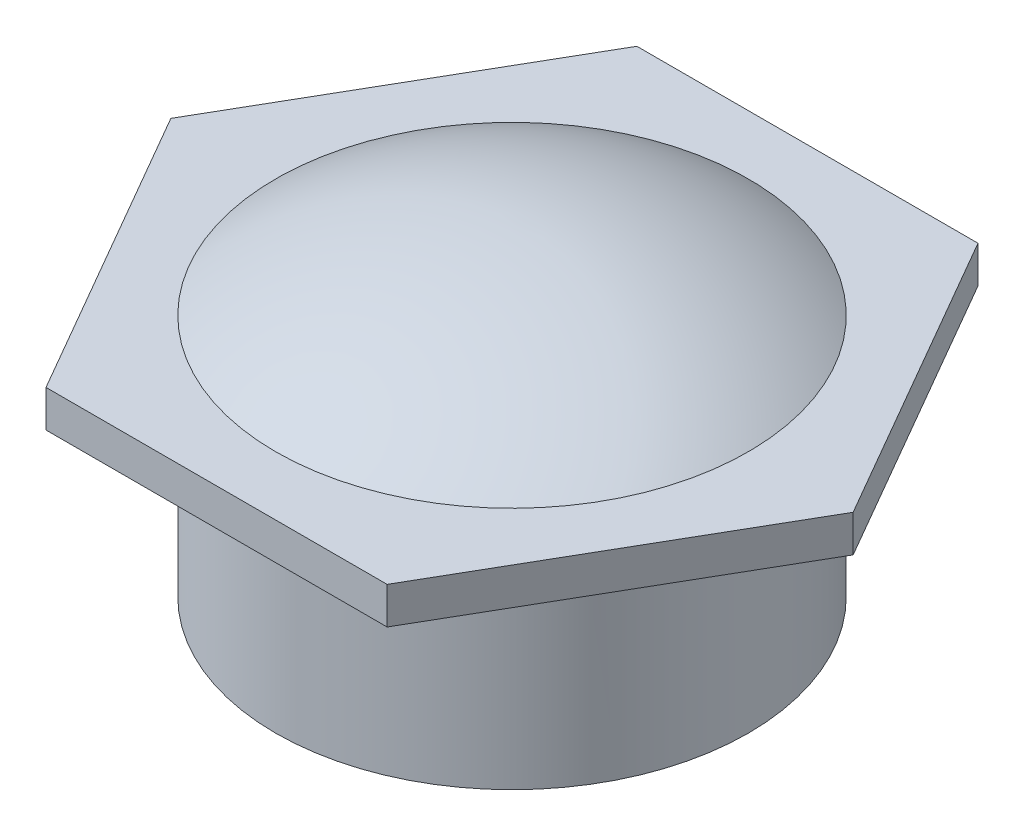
ISO-10303-21;
HEADER;
FILE_DESCRIPTION(('STEP AP214'),'2;1');
FILE_NAME('part.step','',(''),(''),'','','');
FILE_SCHEMA(('AUTOMOTIVE_DESIGN { 1 0 10303 214 1 1 1 1 }'));
ENDSEC;
DATA;
#1=APPLICATION_CONTEXT('core data for automotive mechanical design processes');
#2=APPLICATION_PROTOCOL_DEFINITION('international standard','automotive_design',2000,#1);
#3=PRODUCT_CONTEXT('',#1,'mechanical');
#4=PRODUCT('Part','Part','',(#3));
#5=PRODUCT_RELATED_PRODUCT_CATEGORY('part','',(#4));
#6=PRODUCT_DEFINITION_FORMATION('','',#4);
#7=PRODUCT_DEFINITION_CONTEXT('part definition',#1,'design');
#8=PRODUCT_DEFINITION('design','',#6,#7);
#9=PRODUCT_DEFINITION_SHAPE('','',#8);
#10=(LENGTH_UNIT() NAMED_UNIT(*) SI_UNIT(.MILLI.,.METRE.));
#11=(NAMED_UNIT(*) PLANE_ANGLE_UNIT() SI_UNIT($,.RADIAN.));
#12=(NAMED_UNIT(*) SI_UNIT($,.STERADIAN.) SOLID_ANGLE_UNIT());
#13=UNCERTAINTY_MEASURE_WITH_UNIT(LENGTH_MEASURE(1.E-05),#10,'distance_accuracy_value','');
#14=(GEOMETRIC_REPRESENTATION_CONTEXT(3) GLOBAL_UNCERTAINTY_ASSIGNED_CONTEXT((#13)) GLOBAL_UNIT_ASSIGNED_CONTEXT((#10,
#11,#12)) REPRESENTATION_CONTEXT('',''));
#15=CARTESIAN_POINT('',(0.,0.,0.));
#16=DIRECTION('',(0.,0.,1.));
#17=DIRECTION('',(1.,0.,0.));
#18=AXIS2_PLACEMENT_3D('',#15,#16,#17);
#19=CARTESIAN_POINT('',(0.,2.5,0.));
#20=DIRECTION('',(0.,1.,0.));
#21=DIRECTION('',(0.,0.,1.));
#22=AXIS2_PLACEMENT_3D('',#19,#20,#21);
#23=PLANE('',#22);
#24=DIRECTION('',(1.,0.,0.));
#25=VECTOR('',#24,1.);
#26=CARTESIAN_POINT('',(-11.5470053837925,2.5,20.));
#27=LINE('',#26,#25);
#28=CARTESIAN_POINT('',(-11.5470053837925,2.5,20.));
#29=VERTEX_POINT('',#28);
#30=CARTESIAN_POINT('',(11.5470053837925,2.5,20.));
#31=VERTEX_POINT('',#30);
#32=EDGE_CURVE('E142',#29,#31,#27,.T.);
#33=ORIENTED_EDGE('',*,*,#32,.T.);
#34=DIRECTION('',(0.5,0.,-0.866025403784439));
#35=VECTOR('',#34,1.);
#36=CARTESIAN_POINT('',(11.5470053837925,2.5,20.));
#37=LINE('',#36,#35);
#38=CARTESIAN_POINT('',(23.094010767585,2.5,0.));
#39=VERTEX_POINT('',#38);
#40=EDGE_CURVE('E100',#31,#39,#37,.T.);
#41=ORIENTED_EDGE('',*,*,#40,.T.);
#42=DIRECTION('',(-0.5,0.,-0.866025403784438));
#43=VECTOR('',#42,1.);
#44=CARTESIAN_POINT('',(23.094010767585,2.5,0.));
#45=LINE('',#44,#43);
#46=CARTESIAN_POINT('',(11.5470053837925,2.5,-20.));
#47=VERTEX_POINT('',#46);
#48=EDGE_CURVE('E113',#39,#47,#45,.T.);
#49=ORIENTED_EDGE('',*,*,#48,.T.);
#50=DIRECTION('',(-1.,0.,0.));
#51=VECTOR('',#50,1.);
#52=CARTESIAN_POINT('',(11.5470053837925,2.5,-20.));
#53=LINE('',#52,#51);
#54=CARTESIAN_POINT('',(-11.5470053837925,2.5,-20.));
#55=VERTEX_POINT('',#54);
#56=EDGE_CURVE('E107',#47,#55,#53,.T.);
#57=ORIENTED_EDGE('',*,*,#56,.T.);
#58=DIRECTION('',(-0.5,0.,0.866025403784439));
#59=VECTOR('',#58,1.);
#60=CARTESIAN_POINT('',(-11.5470053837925,2.5,-20.));
#61=LINE('',#60,#59);
#62=CARTESIAN_POINT('',(-23.094010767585,2.5,0.));
#63=VERTEX_POINT('',#62);
#64=EDGE_CURVE('E111',#55,#63,#61,.T.);
#65=ORIENTED_EDGE('',*,*,#64,.T.);
#66=DIRECTION('',(0.5,0.,0.866025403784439));
#67=VECTOR('',#66,1.);
#68=CARTESIAN_POINT('',(-23.094010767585,2.5,0.));
#69=LINE('',#68,#67);
#70=EDGE_CURVE('E62',#63,#29,#69,.T.);
#71=ORIENTED_EDGE('',*,*,#70,.T.);
#72=EDGE_LOOP('',(#33,#41,#49,#57,#65,#71));
#73=FACE_BOUND('',#72,.T.);
#74=CARTESIAN_POINT('',(0.,2.5,0.));
#75=DIRECTION('',(0.,1.,0.));
#76=DIRECTION('',(0.,0.,1.));
#77=AXIS2_PLACEMENT_3D('',#74,#75,#76);
#78=CIRCLE('',#77,16.);
#79=CARTESIAN_POINT('',(0.,2.5,16.));
#80=VERTEX_POINT('',#79);
#81=EDGE_CURVE('E11',#80,#80,#78,.F.);
#82=ORIENTED_EDGE('',*,*,#81,.T.);
#83=EDGE_LOOP('',(#82));
#84=FACE_BOUND('',#83,.T.);
#85=ADVANCED_FACE('F44',(#73,#84),#23,.T.);
#86=CARTESIAN_POINT('',(-11.5470053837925,2.5,20.));
#87=DIRECTION('',(0.,0.,-1.));
#88=DIRECTION('',(-1.,0.,0.));
#89=AXIS2_PLACEMENT_3D('',#86,#87,#88);
#90=PLANE('',#89);
#91=DIRECTION('',(1.,0.,0.));
#92=VECTOR('',#91,1.);
#93=CARTESIAN_POINT('',(-11.5470053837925,0.,20.));
#94=LINE('',#93,#92);
#95=CARTESIAN_POINT('',(-11.5470053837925,0.,20.));
#96=VERTEX_POINT('',#95);
#97=CARTESIAN_POINT('',(11.5470053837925,0.,20.));
#98=VERTEX_POINT('',#97);
#99=EDGE_CURVE('E131',#96,#98,#94,.T.);
#100=ORIENTED_EDGE('',*,*,#99,.T.);
#101=DIRECTION('',(0.,-1.,0.));
#102=VECTOR('',#101,1.);
#103=CARTESIAN_POINT('',(11.5470053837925,2.5,20.));
#104=LINE('',#103,#102);
#105=EDGE_CURVE('E149',#31,#98,#104,.T.);
#106=ORIENTED_EDGE('',*,*,#105,.F.);
#107=ORIENTED_EDGE('',*,*,#32,.F.);
#108=DIRECTION('',(0.,-1.,0.));
#109=VECTOR('',#108,1.);
#110=CARTESIAN_POINT('',(-11.5470053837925,2.5,20.));
#111=LINE('',#110,#109);
#112=EDGE_CURVE('E127',#29,#96,#111,.T.);
#113=ORIENTED_EDGE('',*,*,#112,.T.);
#114=EDGE_LOOP('',(#100,#106,#107,#113));
#115=FACE_BOUND('',#114,.T.);
#116=ADVANCED_FACE('F165',(#115),#90,.F.);
#117=CARTESIAN_POINT('',(11.5470053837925,2.5,20.));
#118=DIRECTION('',(-0.866025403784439,0.,-0.5));
#119=DIRECTION('',(-0.5,0.,0.866025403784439));
#120=AXIS2_PLACEMENT_3D('',#117,#118,#119);
#121=PLANE('',#120);
#122=DIRECTION('',(0.5,0.,-0.866025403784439));
#123=VECTOR('',#122,1.);
#124=CARTESIAN_POINT('',(11.5470053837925,0.,20.));
#125=LINE('',#124,#123);
#126=CARTESIAN_POINT('',(23.094010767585,0.,0.));
#127=VERTEX_POINT('',#126);
#128=EDGE_CURVE('E134',#98,#127,#125,.T.);
#129=ORIENTED_EDGE('',*,*,#128,.T.);
#130=DIRECTION('',(0.,-1.,0.));
#131=VECTOR('',#130,1.);
#132=CARTESIAN_POINT('',(23.094010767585,2.5,0.));
#133=LINE('',#132,#131);
#134=EDGE_CURVE('E146',#39,#127,#133,.T.);
#135=ORIENTED_EDGE('',*,*,#134,.F.);
#136=ORIENTED_EDGE('',*,*,#40,.F.);
#137=ORIENTED_EDGE('',*,*,#105,.T.);
#138=EDGE_LOOP('',(#129,#135,#136,#137));
#139=FACE_BOUND('',#138,.T.);
#140=ADVANCED_FACE('F181',(#139),#121,.F.);
#141=CARTESIAN_POINT('',(23.094010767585,2.5,0.));
#142=DIRECTION('',(-0.866025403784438,0.,0.5));
#143=DIRECTION('',(0.5,0.,0.866025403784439));
#144=AXIS2_PLACEMENT_3D('',#141,#142,#143);
#145=PLANE('',#144);
#146=DIRECTION('',(-0.5,0.,-0.866025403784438));
#147=VECTOR('',#146,1.);
#148=CARTESIAN_POINT('',(23.094010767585,0.,0.));
#149=LINE('',#148,#147);
#150=CARTESIAN_POINT('',(11.5470053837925,0.,-20.));
#151=VERTEX_POINT('',#150);
#152=EDGE_CURVE('E137',#127,#151,#149,.T.);
#153=ORIENTED_EDGE('',*,*,#152,.T.);
#154=DIRECTION('',(0.,-1.,0.));
#155=VECTOR('',#154,1.);
#156=CARTESIAN_POINT('',(11.5470053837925,2.5,-20.));
#157=LINE('',#156,#155);
#158=EDGE_CURVE('E122',#47,#151,#157,.T.);
#159=ORIENTED_EDGE('',*,*,#158,.F.);
#160=ORIENTED_EDGE('',*,*,#48,.F.);
#161=ORIENTED_EDGE('',*,*,#134,.T.);
#162=EDGE_LOOP('',(#153,#159,#160,#161));
#163=FACE_BOUND('',#162,.T.);
#164=ADVANCED_FACE('F210',(#163),#145,.F.);
#165=CARTESIAN_POINT('',(11.5470053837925,2.5,-20.));
#166=DIRECTION('',(0.,0.,1.));
#167=DIRECTION('',(1.,0.,0.));
#168=AXIS2_PLACEMENT_3D('',#165,#166,#167);
#169=PLANE('',#168);
#170=DIRECTION('',(-1.,0.,0.));
#171=VECTOR('',#170,1.);
#172=CARTESIAN_POINT('',(11.5470053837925,0.,-20.));
#173=LINE('',#172,#171);
#174=CARTESIAN_POINT('',(-11.5470053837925,0.,-20.));
#175=VERTEX_POINT('',#174);
#176=EDGE_CURVE('E121',#151,#175,#173,.T.);
#177=ORIENTED_EDGE('',*,*,#176,.T.);
#178=DIRECTION('',(0.,-1.,0.));
#179=VECTOR('',#178,1.);
#180=CARTESIAN_POINT('',(-11.5470053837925,2.5,-20.));
#181=LINE('',#180,#179);
#182=EDGE_CURVE('E118',#55,#175,#181,.T.);
#183=ORIENTED_EDGE('',*,*,#182,.F.);
#184=ORIENTED_EDGE('',*,*,#56,.F.);
#185=ORIENTED_EDGE('',*,*,#158,.T.);
#186=EDGE_LOOP('',(#177,#183,#184,#185));
#187=FACE_BOUND('',#186,.T.);
#188=ADVANCED_FACE('F119',(#187),#169,.F.);
#189=CARTESIAN_POINT('',(-11.5470053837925,2.5,-20.));
#190=DIRECTION('',(0.866025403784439,0.,0.5));
#191=DIRECTION('',(0.5,0.,-0.866025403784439));
#192=AXIS2_PLACEMENT_3D('',#189,#190,#191);
#193=PLANE('',#192);
#194=DIRECTION('',(-0.5,0.,0.866025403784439));
#195=VECTOR('',#194,1.);
#196=CARTESIAN_POINT('',(-11.5470053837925,0.,-20.));
#197=LINE('',#196,#195);
#198=CARTESIAN_POINT('',(-23.094010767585,0.,0.));
#199=VERTEX_POINT('',#198);
#200=EDGE_CURVE('E85',#175,#199,#197,.T.);
#201=ORIENTED_EDGE('',*,*,#200,.T.);
#202=DIRECTION('',(0.,-1.,0.));
#203=VECTOR('',#202,1.);
#204=CARTESIAN_POINT('',(-23.094010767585,2.5,0.));
#205=LINE('',#204,#203);
#206=EDGE_CURVE('E123',#63,#199,#205,.T.);
#207=ORIENTED_EDGE('',*,*,#206,.F.);
#208=ORIENTED_EDGE('',*,*,#64,.F.);
#209=ORIENTED_EDGE('',*,*,#182,.T.);
#210=EDGE_LOOP('',(#201,#207,#208,#209));
#211=FACE_BOUND('',#210,.T.);
#212=ADVANCED_FACE('F125',(#211),#193,.F.);
#213=CARTESIAN_POINT('',(-23.094010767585,2.5,0.));
#214=DIRECTION('',(0.866025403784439,0.,-0.5));
#215=DIRECTION('',(-0.5,0.,-0.866025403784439));
#216=AXIS2_PLACEMENT_3D('',#213,#214,#215);
#217=PLANE('',#216);
#218=DIRECTION('',(0.5,0.,0.866025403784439));
#219=VECTOR('',#218,1.);
#220=CARTESIAN_POINT('',(-23.094010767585,0.,0.));
#221=LINE('',#220,#219);
#222=EDGE_CURVE('E91',#199,#96,#221,.T.);
#223=ORIENTED_EDGE('',*,*,#222,.T.);
#224=ORIENTED_EDGE('',*,*,#112,.F.);
#225=ORIENTED_EDGE('',*,*,#70,.F.);
#226=ORIENTED_EDGE('',*,*,#206,.T.);
#227=EDGE_LOOP('',(#223,#224,#225,#226));
#228=FACE_BOUND('',#227,.T.);
#229=ADVANCED_FACE('F167',(#228),#217,.F.);
#230=CARTESIAN_POINT('',(0.,-20.6,0.));
#231=DIRECTION('',(0.,0.,1.));
#232=DIRECTION('',(1.,0.,0.));
#233=AXIS2_PLACEMENT_3D('',#230,#231,#232);
#234=SPHERICAL_SURFACE('',#233,28.1);
#235=CARTESIAN_POINT('',(0.,-20.6,0.));
#236=DIRECTION('',(0.,1.,0.));
#237=DIRECTION('',(0.,0.,1.));
#238=AXIS2_PLACEMENT_3D('',#235,#236,#237);
#239=SPHERICAL_SURFACE('',#238,28.1);
#240=ORIENTED_EDGE('',*,*,#81,.F.);
#241=EDGE_LOOP('',(#240));
#242=FACE_BOUND('',#241,.T.);
#243=ADVANCED_FACE('F46',(#242),#239,.T.);
#244=CARTESIAN_POINT('',(0.,0.,0.));
#245=DIRECTION('',(0.,1.,0.));
#246=DIRECTION('',(0.,0.,1.));
#247=AXIS2_PLACEMENT_3D('',#244,#245,#246);
#248=PLANE('',#247);
#249=CARTESIAN_POINT('',(0.,0.,0.));
#250=DIRECTION('',(0.,1.,0.));
#251=DIRECTION('',(0.,0.,1.));
#252=AXIS2_PLACEMENT_3D('',#249,#250,#251);
#253=CIRCLE('',#252,16.);
#254=CARTESIAN_POINT('',(0.,0.,16.));
#255=VERTEX_POINT('',#254);
#256=EDGE_CURVE('E54',#255,#255,#253,.F.);
#257=ORIENTED_EDGE('',*,*,#256,.F.);
#258=EDGE_LOOP('',(#257));
#259=FACE_BOUND('',#258,.T.);
#260=ORIENTED_EDGE('',*,*,#99,.F.);
#261=ORIENTED_EDGE('',*,*,#222,.F.);
#262=ORIENTED_EDGE('',*,*,#200,.F.);
#263=ORIENTED_EDGE('',*,*,#176,.F.);
#264=ORIENTED_EDGE('',*,*,#152,.F.);
#265=ORIENTED_EDGE('',*,*,#128,.F.);
#266=EDGE_LOOP('',(#260,#261,#262,#263,#264,#265));
#267=FACE_BOUND('',#266,.T.);
#268=ADVANCED_FACE('F155',(#259,#267),#248,.F.);
#269=CARTESIAN_POINT('',(0.,-14.,0.));
#270=DIRECTION('',(0.,-1.,0.));
#271=DIRECTION('',(0.,0.,-1.));
#272=AXIS2_PLACEMENT_3D('',#269,#270,#271);
#273=PLANE('',#272);
#274=CARTESIAN_POINT('',(0.,-14.,0.));
#275=DIRECTION('',(0.,-1.,0.));
#276=DIRECTION('',(0.,0.,-1.));
#277=AXIS2_PLACEMENT_3D('',#274,#275,#276);
#278=CIRCLE('',#277,16.);
#279=CARTESIAN_POINT('',(0.,-14.,-16.));
#280=VERTEX_POINT('',#279);
#281=EDGE_CURVE('E135',#280,#280,#278,.T.);
#282=ORIENTED_EDGE('',*,*,#281,.T.);
#283=EDGE_LOOP('',(#282));
#284=FACE_BOUND('',#283,.T.);
#285=CARTESIAN_POINT('',(0.,-14.,0.));
#286=DIRECTION('',(0.,-1.,0.));
#287=DIRECTION('',(0.,0.,-1.));
#288=AXIS2_PLACEMENT_3D('',#285,#286,#287);
#289=CIRCLE('',#288,10.);
#290=CARTESIAN_POINT('',(0.,-14.,-10.));
#291=VERTEX_POINT('',#290);
#292=EDGE_CURVE('E199',#291,#291,#289,.T.);
#293=ORIENTED_EDGE('',*,*,#292,.F.);
#294=EDGE_LOOP('',(#293));
#295=FACE_BOUND('',#294,.T.);
#296=ADVANCED_FACE('F158',(#284,#295),#273,.T.);
#297=CARTESIAN_POINT('',(0.,-14.,0.));
#298=DIRECTION('',(0.,1.,0.));
#299=DIRECTION('',(0.,0.,1.));
#300=AXIS2_PLACEMENT_3D('',#297,#298,#299);
#301=CYLINDRICAL_SURFACE('',#300,16.);
#302=ORIENTED_EDGE('',*,*,#281,.F.);
#303=EDGE_LOOP('',(#302));
#304=FACE_BOUND('',#303,.T.);
#305=ORIENTED_EDGE('',*,*,#256,.T.);
#306=EDGE_LOOP('',(#305));
#307=FACE_BOUND('',#306,.T.);
#308=ADVANCED_FACE('F153',(#304,#307),#301,.T.);
#309=CARTESIAN_POINT('',(0.,-14.,0.));
#310=DIRECTION('',(0.,1.,0.));
#311=DIRECTION('',(0.,0.,1.));
#312=AXIS2_PLACEMENT_3D('',#309,#310,#311);
#313=CYLINDRICAL_SURFACE('',#312,10.);
#314=ORIENTED_EDGE('',*,*,#292,.T.);
#315=EDGE_LOOP('',(#314));
#316=FACE_BOUND('',#315,.T.);
#317=CARTESIAN_POINT('',(0.,0.,0.));
#318=DIRECTION('',(0.,-1.,0.));
#319=DIRECTION('',(0.,0.,-1.));
#320=AXIS2_PLACEMENT_3D('',#317,#318,#319);
#321=CIRCLE('',#320,10.);
#322=CARTESIAN_POINT('',(0.,0.,-10.));
#323=VERTEX_POINT('',#322);
#324=EDGE_CURVE('E202',#323,#323,#321,.T.);
#325=ORIENTED_EDGE('',*,*,#324,.F.);
#326=EDGE_LOOP('',(#325));
#327=FACE_BOUND('',#326,.T.);
#328=ADVANCED_FACE('F185',(#316,#327),#313,.F.);
#329=ORIENTED_EDGE('',*,*,#324,.T.);
#330=EDGE_LOOP('',(#329));
#331=FACE_BOUND('',#330,.T.);
#332=ADVANCED_FACE('F160',(#331),#248,.F.);
#333=CLOSED_SHELL('',(#85,#116,#140,#164,#188,#212,#229,#243,#268,#296,#308,#328,#332));
#334=MANIFOLD_SOLID_BREP('B2',#333);
#335=ADVANCED_BREP_SHAPE_REPRESENTATION('',(#18,#334),#14);
#336=SHAPE_DEFINITION_REPRESENTATION(#9,#335);
ENDSEC;
END-ISO-10303-21;
